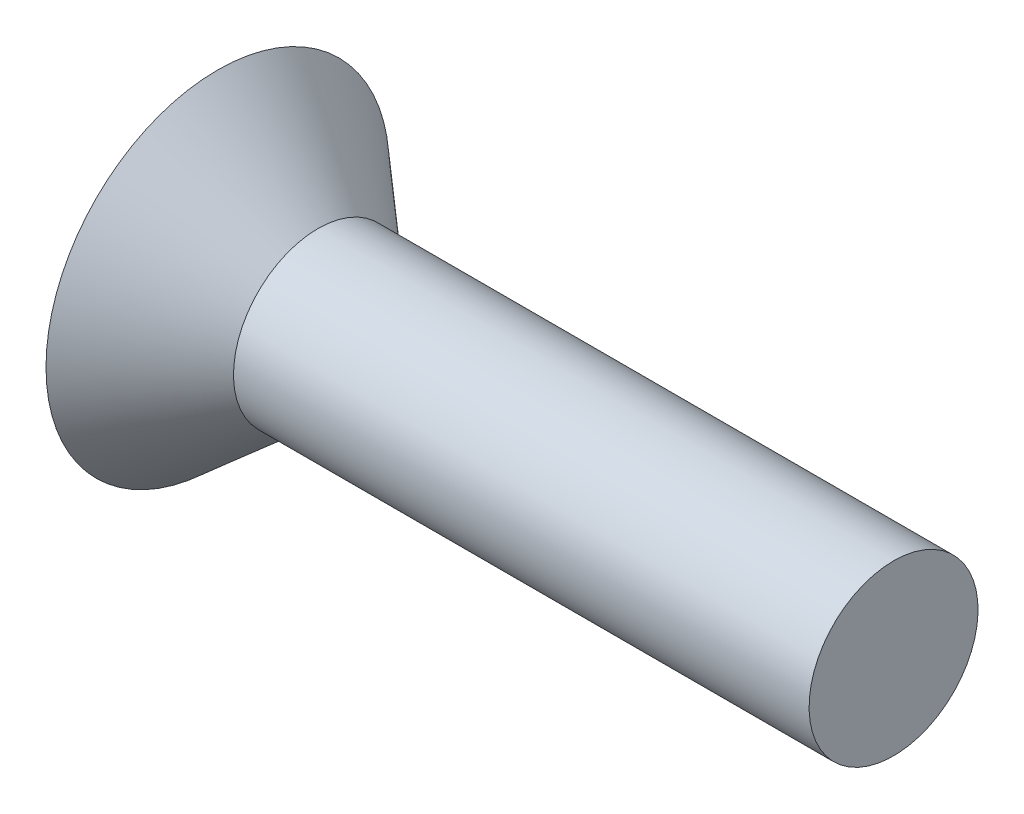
ISO-10303-21;
HEADER;
FILE_DESCRIPTION(('STEP AP214'),'2;1');
FILE_NAME('part.step','',(''),(''),'','','');
FILE_SCHEMA(('AUTOMOTIVE_DESIGN { 1 0 10303 214 1 1 1 1 }'));
ENDSEC;
DATA;
#1=APPLICATION_CONTEXT('core data for automotive mechanical design processes');
#2=APPLICATION_PROTOCOL_DEFINITION('international standard','automotive_design',2000,#1);
#3=PRODUCT_CONTEXT('',#1,'mechanical');
#4=PRODUCT('Part','Part','',(#3));
#5=PRODUCT_RELATED_PRODUCT_CATEGORY('part','',(#4));
#6=PRODUCT_DEFINITION_FORMATION('','',#4);
#7=PRODUCT_DEFINITION_CONTEXT('part definition',#1,'design');
#8=PRODUCT_DEFINITION('design','',#6,#7);
#9=PRODUCT_DEFINITION_SHAPE('','',#8);
#10=(LENGTH_UNIT() NAMED_UNIT(*) SI_UNIT(.MILLI.,.METRE.));
#11=(NAMED_UNIT(*) PLANE_ANGLE_UNIT() SI_UNIT($,.RADIAN.));
#12=(NAMED_UNIT(*) SI_UNIT($,.STERADIAN.) SOLID_ANGLE_UNIT());
#13=UNCERTAINTY_MEASURE_WITH_UNIT(LENGTH_MEASURE(1.E-05),#10,'distance_accuracy_value','');
#14=(GEOMETRIC_REPRESENTATION_CONTEXT(3) GLOBAL_UNCERTAINTY_ASSIGNED_CONTEXT((#13)) GLOBAL_UNIT_ASSIGNED_CONTEXT((#10,
#11,#12)) REPRESENTATION_CONTEXT('',''));
#15=CARTESIAN_POINT('',(0.,0.,0.));
#16=DIRECTION('',(0.,0.,1.));
#17=DIRECTION('',(1.,0.,0.));
#18=AXIS2_PLACEMENT_3D('',#15,#16,#17);
#19=CARTESIAN_POINT('',(38.1,4.76249999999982,0.));
#20=DIRECTION('',(1.,0.,0.));
#21=DIRECTION('',(0.,1.00000000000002,0.));
#22=AXIS2_PLACEMENT_3D('',#19,#20,#21);
#23=PLANE('',#22);
#24=CARTESIAN_POINT('',(38.1,0.,3.88578058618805E-13));
#25=DIRECTION('',(1.,0.,0.));
#26=DIRECTION('',(0.,1.00000000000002,0.));
#27=AXIS2_PLACEMENT_3D('',#24,#25,#26);
#28=CIRCLE('',#27,4.7625);
#29=CARTESIAN_POINT('',(38.1,4.76250000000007,3.85934340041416E-13));
#30=VERTEX_POINT('',#29);
#31=EDGE_CURVE('E11',#30,#30,#28,.T.);
#32=ORIENTED_EDGE('',*,*,#31,.T.);
#33=EDGE_LOOP('',(#32));
#34=FACE_BOUND('',#33,.T.);
#35=ADVANCED_FACE('F381',(#34),#23,.T.);
#36=CARTESIAN_POINT('',(38.1,0.,3.88578058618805E-13));
#37=DIRECTION('',(1.,0.,0.));
#38=DIRECTION('',(0.,1.00000000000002,0.));
#39=AXIS2_PLACEMENT_3D('',#36,#37,#38);
#40=CYLINDRICAL_SURFACE('',#39,4.7625);
#41=CARTESIAN_POINT('',(5.65394568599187,0.,4.40619762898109E-13));
#42=DIRECTION('',(1.,0.,0.));
#43=DIRECTION('',(0.,1.00000000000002,0.));
#44=AXIS2_PLACEMENT_3D('',#41,#42,#43);
#45=CIRCLE('',#44,4.7625);
#46=CARTESIAN_POINT('',(5.65394568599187,4.76250000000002,4.3797604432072E-13));
#47=VERTEX_POINT('',#46);
#48=EDGE_CURVE('E388',#47,#47,#45,.T.);
#49=ORIENTED_EDGE('',*,*,#48,.T.);
#50=EDGE_LOOP('',(#49));
#51=FACE_BOUND('',#50,.T.);
#52=ORIENTED_EDGE('',*,*,#31,.F.);
#53=EDGE_LOOP('',(#52));
#54=FACE_BOUND('',#53,.T.);
#55=ADVANCED_FACE('F494',(#51,#54),#40,.T.);
#56=CARTESIAN_POINT('',(5.65394568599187,0.,4.40619762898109E-13));
#57=DIRECTION('',(-1.,0.,0.));
#58=DIRECTION('',(0.,-1.00000000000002,0.));
#59=AXIS2_PLACEMENT_3D('',#56,#57,#58);
#60=CONICAL_SURFACE('',#59,4.7625,0.71558499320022);
#61=CARTESIAN_POINT('',(0.,0.,0.));
#62=DIRECTION('',(1.,0.,0.));
#63=DIRECTION('',(0.,1.00000000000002,0.));
#64=AXIS2_PLACEMENT_3D('',#61,#62,#63);
#65=CIRCLE('',#64,9.6774);
#66=CARTESIAN_POINT('',(0.,9.67740000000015,0.));
#67=VERTEX_POINT('',#66);
#68=EDGE_CURVE('E483',#67,#67,#65,.T.);
#69=ORIENTED_EDGE('',*,*,#68,.T.);
#70=EDGE_LOOP('',(#69));
#71=FACE_BOUND('',#70,.T.);
#72=ORIENTED_EDGE('',*,*,#48,.F.);
#73=EDGE_LOOP('',(#72));
#74=FACE_BOUND('',#73,.T.);
#75=ADVANCED_FACE('F497',(#71,#74),#60,.T.);
#76=CARTESIAN_POINT('',(0.,0.,0.));
#77=DIRECTION('',(-1.,0.,0.));
#78=DIRECTION('',(0.,-1.00000000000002,0.));
#79=AXIS2_PLACEMENT_3D('',#76,#77,#78);
#80=PLANE('',#79);
#81=DIRECTION('',(0.,-0.500000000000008,-0.866025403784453));
#82=VECTOR('',#81,1.);
#83=CARTESIAN_POINT('',(0.,3.1969039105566,0.));
#84=LINE('',#83,#82);
#85=CARTESIAN_POINT('',(0.,3.1969039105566,0.));
#86=VERTEX_POINT('',#85);
#87=CARTESIAN_POINT('',(0.,1.59845195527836,-2.76860000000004));
#88=VERTEX_POINT('',#87);
#89=EDGE_CURVE('E395',#86,#88,#84,.T.);
#90=ORIENTED_EDGE('',*,*,#89,.F.);
#91=DIRECTION('',(0.,0.500000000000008,-0.866025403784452));
#92=VECTOR('',#91,1.);
#93=CARTESIAN_POINT('',(0.,1.59845195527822,2.76860000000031));
#94=LINE('',#93,#92);
#95=CARTESIAN_POINT('',(0.,1.59845195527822,2.76860000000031));
#96=VERTEX_POINT('',#95);
#97=EDGE_CURVE('E465',#96,#86,#94,.T.);
#98=ORIENTED_EDGE('',*,*,#97,.F.);
#99=DIRECTION('',(0.,1.00000000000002,0.));
#100=VECTOR('',#99,1.);
#101=CARTESIAN_POINT('',(0.,-1.59845195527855,2.76860000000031));
#102=LINE('',#101,#100);
#103=CARTESIAN_POINT('',(0.,-1.59845195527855,2.76860000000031));
#104=VERTEX_POINT('',#103);
#105=EDGE_CURVE('E459',#104,#96,#102,.T.);
#106=ORIENTED_EDGE('',*,*,#105,.F.);
#107=DIRECTION('',(0.,0.500000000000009,0.866025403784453));
#108=VECTOR('',#107,1.);
#109=CARTESIAN_POINT('',(0.,-3.19690391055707,1.97758476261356E-13));
#110=LINE('',#109,#108);
#111=CARTESIAN_POINT('',(0.,-3.19690391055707,1.97758476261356E-13));
#112=VERTEX_POINT('',#111);
#113=EDGE_CURVE('E457',#112,#104,#110,.T.);
#114=ORIENTED_EDGE('',*,*,#113,.F.);
#115=DIRECTION('',(0.,-0.500000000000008,0.866025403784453));
#116=VECTOR('',#115,1.);
#117=CARTESIAN_POINT('',(0.,-1.59845195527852,-2.76860000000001));
#118=LINE('',#117,#116);
#119=CARTESIAN_POINT('',(0.,-1.59845195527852,-2.76860000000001));
#120=VERTEX_POINT('',#119);
#121=EDGE_CURVE('E438',#120,#112,#118,.T.);
#122=ORIENTED_EDGE('',*,*,#121,.F.);
#123=DIRECTION('',(0.,-1.00000000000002,0.));
#124=VECTOR('',#123,1.);
#125=CARTESIAN_POINT('',(0.,1.59845195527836,-2.76860000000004));
#126=LINE('',#125,#124);
#127=EDGE_CURVE('E449',#88,#120,#126,.T.);
#128=ORIENTED_EDGE('',*,*,#127,.F.);
#129=EDGE_LOOP('',(#90,#98,#106,#114,#122,#128));
#130=FACE_BOUND('',#129,.T.);
#131=ORIENTED_EDGE('',*,*,#68,.F.);
#132=EDGE_LOOP('',(#131));
#133=FACE_BOUND('',#132,.T.);
#134=ADVANCED_FACE('F453',(#130,#133),#80,.T.);
#135=CARTESIAN_POINT('',(4.06400000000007,3.19690391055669,0.));
#136=DIRECTION('',(0.,0.866025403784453,-0.500000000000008));
#137=DIRECTION('',(0.,0.500000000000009,0.866025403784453));
#138=AXIS2_PLACEMENT_3D('',#135,#136,#137);
#139=PLANE('',#138);
#140=ORIENTED_EDGE('',*,*,#89,.T.);
#141=DIRECTION('',(-1.,0.,0.));
#142=VECTOR('',#141,1.);
#143=CARTESIAN_POINT('',(4.06400000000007,1.59845195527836,-2.76860000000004));
#144=LINE('',#143,#142);
#145=CARTESIAN_POINT('',(4.06400000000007,1.59845195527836,-2.76860000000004));
#146=VERTEX_POINT('',#145);
#147=EDGE_CURVE('E446',#146,#88,#144,.T.);
#148=ORIENTED_EDGE('',*,*,#147,.F.);
#149=DIRECTION('',(0.,-0.500000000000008,-0.866025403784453));
#150=VECTOR('',#149,1.);
#151=CARTESIAN_POINT('',(4.06400000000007,3.19690391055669,0.));
#152=LINE('',#151,#150);
#153=CARTESIAN_POINT('',(4.06400000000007,3.19690391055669,0.));
#154=VERTEX_POINT('',#153);
#155=EDGE_CURVE('E467',#154,#146,#152,.T.);
#156=ORIENTED_EDGE('',*,*,#155,.F.);
#157=DIRECTION('',(-1.,0.,0.));
#158=VECTOR('',#157,1.);
#159=CARTESIAN_POINT('',(4.06400000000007,3.19690391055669,0.));
#160=LINE('',#159,#158);
#161=EDGE_CURVE('E402',#154,#86,#160,.T.);
#162=ORIENTED_EDGE('',*,*,#161,.T.);
#163=EDGE_LOOP('',(#140,#148,#156,#162));
#164=FACE_BOUND('',#163,.T.);
#165=ADVANCED_FACE('F505',(#164),#139,.F.);
#166=CARTESIAN_POINT('',(4.06400000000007,1.59845195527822,2.76860000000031));
#167=DIRECTION('',(0.,0.866025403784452,0.500000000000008));
#168=DIRECTION('',(0.,-0.500000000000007,0.866025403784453));
#169=AXIS2_PLACEMENT_3D('',#166,#167,#168);
#170=PLANE('',#169);
#171=ORIENTED_EDGE('',*,*,#97,.T.);
#172=ORIENTED_EDGE('',*,*,#161,.F.);
#173=DIRECTION('',(0.,0.500000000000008,-0.866025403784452));
#174=VECTOR('',#173,1.);
#175=CARTESIAN_POINT('',(4.06400000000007,1.59845195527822,2.76860000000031));
#176=LINE('',#175,#174);
#177=CARTESIAN_POINT('',(4.06400000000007,1.59845195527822,2.76860000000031));
#178=VERTEX_POINT('',#177);
#179=EDGE_CURVE('E479',#178,#154,#176,.T.);
#180=ORIENTED_EDGE('',*,*,#179,.F.);
#181=DIRECTION('',(-1.,0.,0.));
#182=VECTOR('',#181,1.);
#183=CARTESIAN_POINT('',(4.06400000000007,1.59845195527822,2.76860000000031));
#184=LINE('',#183,#182);
#185=EDGE_CURVE('E484',#178,#96,#184,.T.);
#186=ORIENTED_EDGE('',*,*,#185,.T.);
#187=EDGE_LOOP('',(#171,#172,#180,#186));
#188=FACE_BOUND('',#187,.T.);
#189=ADVANCED_FACE('F517',(#188),#170,.F.);
#190=CARTESIAN_POINT('',(4.06400000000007,-1.59845195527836,2.76860000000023));
#191=DIRECTION('',(0.,0.,1.00000000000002));
#192=DIRECTION('',(1.,0.,0.));
#193=AXIS2_PLACEMENT_3D('',#190,#191,#192);
#194=PLANE('',#193);
#195=ORIENTED_EDGE('',*,*,#105,.T.);
#196=ORIENTED_EDGE('',*,*,#185,.F.);
#197=DIRECTION('',(0.,1.00000000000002,0.));
#198=VECTOR('',#197,1.);
#199=CARTESIAN_POINT('',(4.06400000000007,-1.59845195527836,2.76860000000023));
#200=LINE('',#199,#198);
#201=CARTESIAN_POINT('',(4.06400000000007,-1.59845195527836,2.76860000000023));
#202=VERTEX_POINT('',#201);
#203=EDGE_CURVE('E476',#202,#178,#200,.T.);
#204=ORIENTED_EDGE('',*,*,#203,.F.);
#205=DIRECTION('',(-1.,0.,0.));
#206=VECTOR('',#205,1.);
#207=CARTESIAN_POINT('',(4.06400000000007,-1.59845195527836,2.76860000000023));
#208=LINE('',#207,#206);
#209=EDGE_CURVE('E486',#202,#104,#208,.T.);
#210=ORIENTED_EDGE('',*,*,#209,.T.);
#211=EDGE_LOOP('',(#195,#196,#204,#210));
#212=FACE_BOUND('',#211,.T.);
#213=ADVANCED_FACE('F526',(#212),#194,.F.);
#214=CARTESIAN_POINT('',(4.06400000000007,-3.19690391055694,0.));
#215=DIRECTION('',(0.,-0.866025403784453,0.500000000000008));
#216=DIRECTION('',(0.,-0.500000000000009,-0.866025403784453));
#217=AXIS2_PLACEMENT_3D('',#214,#215,#216);
#218=PLANE('',#217);
#219=ORIENTED_EDGE('',*,*,#113,.T.);
#220=ORIENTED_EDGE('',*,*,#209,.F.);
#221=DIRECTION('',(0.,0.500000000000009,0.866025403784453));
#222=VECTOR('',#221,1.);
#223=CARTESIAN_POINT('',(4.06400000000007,-3.19690391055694,0.));
#224=LINE('',#223,#222);
#225=CARTESIAN_POINT('',(4.06400000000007,-3.19690391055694,0.));
#226=VERTEX_POINT('',#225);
#227=EDGE_CURVE('E473',#226,#202,#224,.T.);
#228=ORIENTED_EDGE('',*,*,#227,.F.);
#229=DIRECTION('',(-1.,0.,0.));
#230=VECTOR('',#229,1.);
#231=CARTESIAN_POINT('',(4.06400000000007,-3.19690391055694,0.));
#232=LINE('',#231,#230);
#233=EDGE_CURVE('E445',#226,#112,#232,.T.);
#234=ORIENTED_EDGE('',*,*,#233,.T.);
#235=EDGE_LOOP('',(#219,#220,#228,#234));
#236=FACE_BOUND('',#235,.T.);
#237=ADVANCED_FACE('F523',(#236),#218,.F.);
#238=CARTESIAN_POINT('',(4.06400000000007,-1.59845195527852,-2.76860000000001));
#239=DIRECTION('',(0.,-0.866025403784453,-0.500000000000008));
#240=DIRECTION('',(0.,0.500000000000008,-0.866025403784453));
#241=AXIS2_PLACEMENT_3D('',#238,#239,#240);
#242=PLANE('',#241);
#243=ORIENTED_EDGE('',*,*,#121,.T.);
#244=ORIENTED_EDGE('',*,*,#233,.F.);
#245=DIRECTION('',(0.,-0.500000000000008,0.866025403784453));
#246=VECTOR('',#245,1.);
#247=CARTESIAN_POINT('',(4.06400000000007,-1.59845195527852,-2.76860000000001));
#248=LINE('',#247,#246);
#249=CARTESIAN_POINT('',(4.06400000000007,-1.59845195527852,-2.76860000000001));
#250=VERTEX_POINT('',#249);
#251=EDGE_CURVE('E441',#250,#226,#248,.T.);
#252=ORIENTED_EDGE('',*,*,#251,.F.);
#253=DIRECTION('',(-1.,0.,0.));
#254=VECTOR('',#253,1.);
#255=CARTESIAN_POINT('',(4.06400000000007,-1.59845195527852,-2.76860000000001));
#256=LINE('',#255,#254);
#257=EDGE_CURVE('E434',#250,#120,#256,.T.);
#258=ORIENTED_EDGE('',*,*,#257,.T.);
#259=EDGE_LOOP('',(#243,#244,#252,#258));
#260=FACE_BOUND('',#259,.T.);
#261=ADVANCED_FACE('F436',(#260),#242,.F.);
#262=CARTESIAN_POINT('',(4.06400000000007,1.59845195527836,-2.76860000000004));
#263=DIRECTION('',(0.,0.,-1.00000000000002));
#264=DIRECTION('',(-1.,0.,0.));
#265=AXIS2_PLACEMENT_3D('',#262,#263,#264);
#266=PLANE('',#265);
#267=ORIENTED_EDGE('',*,*,#127,.T.);
#268=ORIENTED_EDGE('',*,*,#257,.F.);
#269=DIRECTION('',(0.,-1.00000000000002,0.));
#270=VECTOR('',#269,1.);
#271=CARTESIAN_POINT('',(4.06400000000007,1.59845195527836,-2.76860000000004));
#272=LINE('',#271,#270);
#273=EDGE_CURVE('E470',#146,#250,#272,.T.);
#274=ORIENTED_EDGE('',*,*,#273,.F.);
#275=ORIENTED_EDGE('',*,*,#147,.T.);
#276=EDGE_LOOP('',(#267,#268,#274,#275));
#277=FACE_BOUND('',#276,.T.);
#278=ADVANCED_FACE('F450',(#277),#266,.F.);
#279=CARTESIAN_POINT('',(4.06400000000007,3.19690391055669,0.));
#280=DIRECTION('',(1.,0.,0.));
#281=DIRECTION('',(0.,1.00000000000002,0.));
#282=AXIS2_PLACEMENT_3D('',#279,#280,#281);
#283=PLANE('',#282);
#284=ORIENTED_EDGE('',*,*,#155,.T.);
#285=ORIENTED_EDGE('',*,*,#273,.T.);
#286=ORIENTED_EDGE('',*,*,#251,.T.);
#287=ORIENTED_EDGE('',*,*,#227,.T.);
#288=ORIENTED_EDGE('',*,*,#203,.T.);
#289=ORIENTED_EDGE('',*,*,#179,.T.);
#290=EDGE_LOOP('',(#284,#285,#286,#287,#288,#289));
#291=FACE_BOUND('',#290,.T.);
#292=ADVANCED_FACE('F520',(#291),#283,.F.);
#293=CLOSED_SHELL('',(#35,#55,#75,#134,#165,#189,#213,#237,#261,#278,#292));
#294=MANIFOLD_SOLID_BREP('B2',#293);
#295=ADVANCED_BREP_SHAPE_REPRESENTATION('',(#18,#294),#14);
#296=SHAPE_DEFINITION_REPRESENTATION(#9,#295);
ENDSEC;
END-ISO-10303-21;
